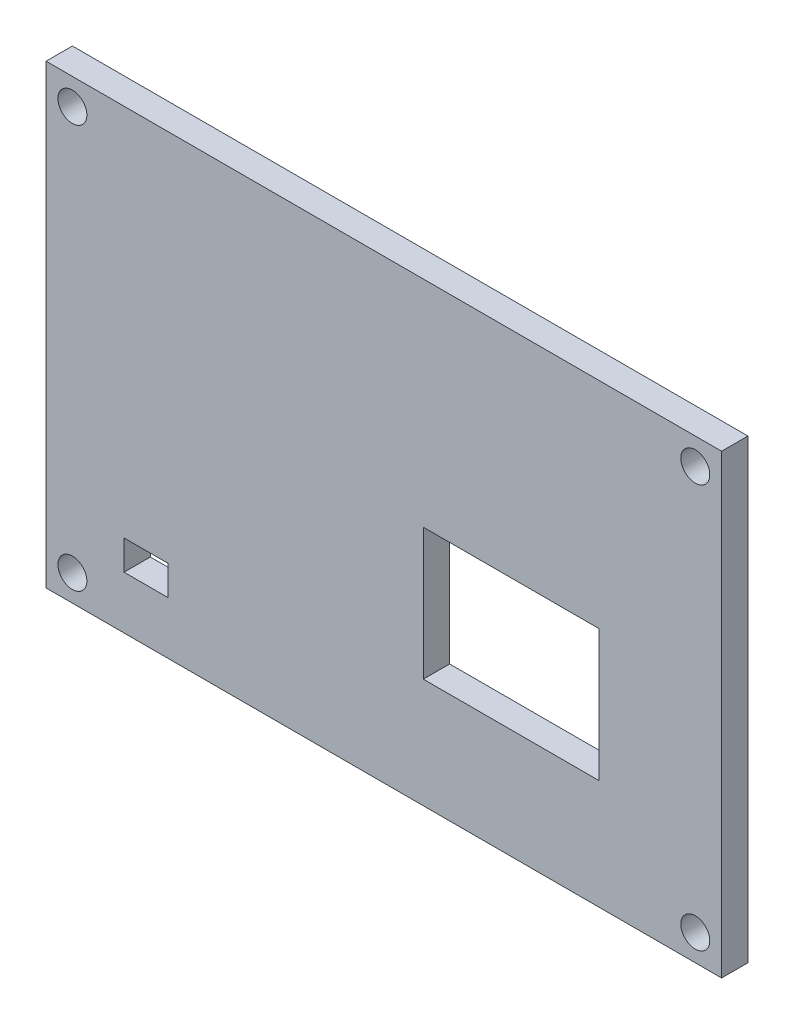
ISO-10303-21;
HEADER;
FILE_DESCRIPTION(('STEP AP214'),'2;1');
FILE_NAME('part.step','',(''),(''),'','','');
FILE_SCHEMA(('AUTOMOTIVE_DESIGN { 1 0 10303 214 1 1 1 1 }'));
ENDSEC;
DATA;
#1=APPLICATION_CONTEXT('core data for automotive mechanical design processes');
#2=APPLICATION_PROTOCOL_DEFINITION('international standard','automotive_design',2000,#1);
#3=PRODUCT_CONTEXT('',#1,'mechanical');
#4=PRODUCT('Part','Part','',(#3));
#5=PRODUCT_RELATED_PRODUCT_CATEGORY('part','',(#4));
#6=PRODUCT_DEFINITION_FORMATION('','',#4);
#7=PRODUCT_DEFINITION_CONTEXT('part definition',#1,'design');
#8=PRODUCT_DEFINITION('design','',#6,#7);
#9=PRODUCT_DEFINITION_SHAPE('','',#8);
#10=(LENGTH_UNIT() NAMED_UNIT(*) SI_UNIT(.MILLI.,.METRE.));
#11=(NAMED_UNIT(*) PLANE_ANGLE_UNIT() SI_UNIT($,.RADIAN.));
#12=(NAMED_UNIT(*) SI_UNIT($,.STERADIAN.) SOLID_ANGLE_UNIT());
#13=UNCERTAINTY_MEASURE_WITH_UNIT(LENGTH_MEASURE(1.E-05),#10,'distance_accuracy_value','');
#14=(GEOMETRIC_REPRESENTATION_CONTEXT(3) GLOBAL_UNCERTAINTY_ASSIGNED_CONTEXT((#13)) GLOBAL_UNIT_ASSIGNED_CONTEXT((#10,
#11,#12)) REPRESENTATION_CONTEXT('',''));
#15=CARTESIAN_POINT('',(0.,0.,0.));
#16=DIRECTION('',(0.,0.,1.));
#17=DIRECTION('',(1.,0.,0.));
#18=AXIS2_PLACEMENT_3D('',#15,#16,#17);
#19=CARTESIAN_POINT('',(0.,0.,3.));
#20=DIRECTION('',(0.,0.,-1.));
#21=DIRECTION('',(-1.,0.,0.));
#22=AXIS2_PLACEMENT_3D('',#19,#20,#21);
#23=PLANE('',#22);
#24=DIRECTION('',(0.,1.,0.));
#25=VECTOR('',#24,1.);
#26=CARTESIAN_POINT('',(24.5,-13.5,3.));
#27=LINE('',#26,#25);
#28=CARTESIAN_POINT('',(24.5,-13.5,3.));
#29=VERTEX_POINT('',#28);
#30=CARTESIAN_POINT('',(24.5,1.5,3.));
#31=VERTEX_POINT('',#30);
#32=EDGE_CURVE('E183',#29,#31,#27,.T.);
#33=ORIENTED_EDGE('',*,*,#32,.F.);
#34=DIRECTION('',(1.,0.,0.));
#35=VECTOR('',#34,1.);
#36=CARTESIAN_POINT('',(24.5,-13.5,3.));
#37=LINE('',#36,#35);
#38=CARTESIAN_POINT('',(4.5,-13.5,3.));
#39=VERTEX_POINT('',#38);
#40=EDGE_CURVE('E194',#39,#29,#37,.T.);
#41=ORIENTED_EDGE('',*,*,#40,.F.);
#42=DIRECTION('',(0.,-1.,0.));
#43=VECTOR('',#42,1.);
#44=CARTESIAN_POINT('',(4.5,-13.5,3.));
#45=LINE('',#44,#43);
#46=CARTESIAN_POINT('',(4.5,1.5,3.));
#47=VERTEX_POINT('',#46);
#48=EDGE_CURVE('E190',#47,#39,#45,.T.);
#49=ORIENTED_EDGE('',*,*,#48,.F.);
#50=DIRECTION('',(-1.,0.,0.));
#51=VECTOR('',#50,1.);
#52=CARTESIAN_POINT('',(24.5,1.5,3.));
#53=LINE('',#52,#51);
#54=EDGE_CURVE('E186',#31,#47,#53,.T.);
#55=ORIENTED_EDGE('',*,*,#54,.F.);
#56=EDGE_LOOP('',(#33,#41,#49,#55));
#57=FACE_BOUND('',#56,.T.);
#58=DIRECTION('',(0.,1.,0.));
#59=VECTOR('',#58,1.);
#60=CARTESIAN_POINT('',(38.5,-26.,3.));
#61=LINE('',#60,#59);
#62=CARTESIAN_POINT('',(38.5,-26.,3.));
#63=VERTEX_POINT('',#62);
#64=CARTESIAN_POINT('',(38.5,26.,3.));
#65=VERTEX_POINT('',#64);
#66=EDGE_CURVE('E258',#63,#65,#61,.T.);
#67=ORIENTED_EDGE('',*,*,#66,.T.);
#68=DIRECTION('',(-1.,0.,0.));
#69=VECTOR('',#68,1.);
#70=CARTESIAN_POINT('',(-38.5,26.,3.));
#71=LINE('',#70,#69);
#72=CARTESIAN_POINT('',(-38.5,26.,3.));
#73=VERTEX_POINT('',#72);
#74=EDGE_CURVE('E262',#65,#73,#71,.T.);
#75=ORIENTED_EDGE('',*,*,#74,.T.);
#76=DIRECTION('',(0.,-1.,0.));
#77=VECTOR('',#76,1.);
#78=CARTESIAN_POINT('',(-38.5,-26.,3.));
#79=LINE('',#78,#77);
#80=CARTESIAN_POINT('',(-38.5,-26.,3.));
#81=VERTEX_POINT('',#80);
#82=EDGE_CURVE('E266',#73,#81,#79,.T.);
#83=ORIENTED_EDGE('',*,*,#82,.T.);
#84=DIRECTION('',(1.,0.,0.));
#85=VECTOR('',#84,1.);
#86=CARTESIAN_POINT('',(-38.5,-26.,3.));
#87=LINE('',#86,#85);
#88=EDGE_CURVE('E269',#81,#63,#87,.T.);
#89=ORIENTED_EDGE('',*,*,#88,.T.);
#90=EDGE_LOOP('',(#67,#75,#83,#89));
#91=FACE_BOUND('',#90,.T.);
#92=CARTESIAN_POINT('',(-35.5,23.,3.));
#93=DIRECTION('',(0.,0.,1.));
#94=DIRECTION('',(1.,0.,0.));
#95=AXIS2_PLACEMENT_3D('',#92,#93,#94);
#96=CIRCLE('',#95,1.65);
#97=CARTESIAN_POINT('',(-33.85,23.,3.));
#98=VERTEX_POINT('',#97);
#99=EDGE_CURVE('E250',#98,#98,#96,.T.);
#100=ORIENTED_EDGE('',*,*,#99,.F.);
#101=EDGE_LOOP('',(#100));
#102=FACE_BOUND('',#101,.T.);
#103=CARTESIAN_POINT('',(35.5,23.,3.));
#104=DIRECTION('',(0.,0.,1.));
#105=DIRECTION('',(-1.,0.,0.));
#106=AXIS2_PLACEMENT_3D('',#103,#104,#105);
#107=CIRCLE('',#106,1.65);
#108=CARTESIAN_POINT('',(33.85,23.,3.));
#109=VERTEX_POINT('',#108);
#110=EDGE_CURVE('E242',#109,#109,#107,.T.);
#111=ORIENTED_EDGE('',*,*,#110,.F.);
#112=EDGE_LOOP('',(#111));
#113=FACE_BOUND('',#112,.T.);
#114=CARTESIAN_POINT('',(35.5,-23.,3.));
#115=DIRECTION('',(0.,0.,1.));
#116=DIRECTION('',(1.,0.,0.));
#117=AXIS2_PLACEMENT_3D('',#114,#115,#116);
#118=CIRCLE('',#117,1.65);
#119=CARTESIAN_POINT('',(37.15,-23.,3.));
#120=VERTEX_POINT('',#119);
#121=EDGE_CURVE('E234',#120,#120,#118,.T.);
#122=ORIENTED_EDGE('',*,*,#121,.F.);
#123=EDGE_LOOP('',(#122));
#124=FACE_BOUND('',#123,.T.);
#125=CARTESIAN_POINT('',(-35.5,-23.,3.));
#126=DIRECTION('',(0.,0.,1.));
#127=DIRECTION('',(-1.,0.,0.));
#128=AXIS2_PLACEMENT_3D('',#125,#126,#127);
#129=CIRCLE('',#128,1.65);
#130=CARTESIAN_POINT('',(-37.15,-23.,3.));
#131=VERTEX_POINT('',#130);
#132=EDGE_CURVE('E226',#131,#131,#129,.T.);
#133=ORIENTED_EDGE('',*,*,#132,.F.);
#134=EDGE_LOOP('',(#133));
#135=FACE_BOUND('',#134,.T.);
#136=DIRECTION('',(0.,-1.,0.));
#137=VECTOR('',#136,1.);
#138=CARTESIAN_POINT('',(-29.6153846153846,-20.,3.));
#139=LINE('',#138,#137);
#140=CARTESIAN_POINT('',(-29.6153846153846,-16.6183265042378,3.));
#141=VERTEX_POINT('',#140);
#142=CARTESIAN_POINT('',(-29.6153846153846,-20.,3.));
#143=VERTEX_POINT('',#142);
#144=EDGE_CURVE('E135',#141,#143,#139,.T.);
#145=ORIENTED_EDGE('',*,*,#144,.F.);
#146=DIRECTION('',(-1.,0.,0.));
#147=VECTOR('',#146,1.);
#148=CARTESIAN_POINT('',(-29.6153846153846,-16.6183265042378,3.));
#149=LINE('',#148,#147);
#150=CARTESIAN_POINT('',(-24.6079065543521,-16.6183265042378,3.));
#151=VERTEX_POINT('',#150);
#152=EDGE_CURVE('E161',#151,#141,#149,.T.);
#153=ORIENTED_EDGE('',*,*,#152,.F.);
#154=DIRECTION('',(0.,1.,0.));
#155=VECTOR('',#154,1.);
#156=CARTESIAN_POINT('',(-24.6079065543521,-20.,3.));
#157=LINE('',#156,#155);
#158=CARTESIAN_POINT('',(-24.6079065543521,-20.,3.));
#159=VERTEX_POINT('',#158);
#160=EDGE_CURVE('E157',#159,#151,#157,.T.);
#161=ORIENTED_EDGE('',*,*,#160,.F.);
#162=DIRECTION('',(1.,0.,0.));
#163=VECTOR('',#162,1.);
#164=CARTESIAN_POINT('',(-29.6153846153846,-20.,3.));
#165=LINE('',#164,#163);
#166=EDGE_CURVE('E144',#143,#159,#165,.T.);
#167=ORIENTED_EDGE('',*,*,#166,.F.);
#168=EDGE_LOOP('',(#145,#153,#161,#167));
#169=FACE_BOUND('',#168,.T.);
#170=ADVANCED_FACE('F45',(#57,#91,#102,#113,#124,#135,#169),#23,.F.);
#171=CARTESIAN_POINT('',(0.,0.,0.));
#172=DIRECTION('',(0.,0.,-1.));
#173=DIRECTION('',(-1.,0.,0.));
#174=AXIS2_PLACEMENT_3D('',#171,#172,#173);
#175=PLANE('',#174);
#176=CARTESIAN_POINT('',(35.5,-23.,0.));
#177=DIRECTION('',(0.,0.,1.));
#178=DIRECTION('',(1.,0.,0.));
#179=AXIS2_PLACEMENT_3D('',#176,#177,#178);
#180=CIRCLE('',#179,1.65);
#181=CARTESIAN_POINT('',(37.15,-23.,0.));
#182=VERTEX_POINT('',#181);
#183=EDGE_CURVE('E230',#182,#182,#180,.T.);
#184=ORIENTED_EDGE('',*,*,#183,.T.);
#185=EDGE_LOOP('',(#184));
#186=FACE_BOUND('',#185,.T.);
#187=CARTESIAN_POINT('',(-35.5,23.,0.));
#188=DIRECTION('',(0.,0.,1.));
#189=DIRECTION('',(1.,0.,0.));
#190=AXIS2_PLACEMENT_3D('',#187,#188,#189);
#191=CIRCLE('',#190,1.65);
#192=CARTESIAN_POINT('',(-33.85,23.,0.));
#193=VERTEX_POINT('',#192);
#194=EDGE_CURVE('E246',#193,#193,#191,.T.);
#195=ORIENTED_EDGE('',*,*,#194,.T.);
#196=EDGE_LOOP('',(#195));
#197=FACE_BOUND('',#196,.T.);
#198=DIRECTION('',(0.,1.,0.));
#199=VECTOR('',#198,1.);
#200=CARTESIAN_POINT('',(38.5,-26.,0.));
#201=LINE('',#200,#199);
#202=CARTESIAN_POINT('',(38.5,-26.,0.));
#203=VERTEX_POINT('',#202);
#204=CARTESIAN_POINT('',(38.5,26.,0.));
#205=VERTEX_POINT('',#204);
#206=EDGE_CURVE('E254',#203,#205,#201,.T.);
#207=ORIENTED_EDGE('',*,*,#206,.F.);
#208=DIRECTION('',(1.,0.,0.));
#209=VECTOR('',#208,1.);
#210=CARTESIAN_POINT('',(-38.5,-26.,0.));
#211=LINE('',#210,#209);
#212=CARTESIAN_POINT('',(-38.5,-26.,0.));
#213=VERTEX_POINT('',#212);
#214=EDGE_CURVE('E263',#213,#203,#211,.T.);
#215=ORIENTED_EDGE('',*,*,#214,.F.);
#216=DIRECTION('',(0.,-1.,0.));
#217=VECTOR('',#216,1.);
#218=CARTESIAN_POINT('',(-38.5,-26.,0.));
#219=LINE('',#218,#217);
#220=CARTESIAN_POINT('',(-38.5,26.,0.));
#221=VERTEX_POINT('',#220);
#222=EDGE_CURVE('E279',#221,#213,#219,.T.);
#223=ORIENTED_EDGE('',*,*,#222,.F.);
#224=DIRECTION('',(-1.,0.,0.));
#225=VECTOR('',#224,1.);
#226=CARTESIAN_POINT('',(-38.5,26.,0.));
#227=LINE('',#226,#225);
#228=EDGE_CURVE('E276',#205,#221,#227,.T.);
#229=ORIENTED_EDGE('',*,*,#228,.F.);
#230=EDGE_LOOP('',(#207,#215,#223,#229));
#231=FACE_BOUND('',#230,.T.);
#232=CARTESIAN_POINT('',(35.5,23.,0.));
#233=DIRECTION('',(0.,0.,1.));
#234=DIRECTION('',(-1.,0.,0.));
#235=AXIS2_PLACEMENT_3D('',#232,#233,#234);
#236=CIRCLE('',#235,1.65);
#237=CARTESIAN_POINT('',(33.85,23.,0.));
#238=VERTEX_POINT('',#237);
#239=EDGE_CURVE('E238',#238,#238,#236,.T.);
#240=ORIENTED_EDGE('',*,*,#239,.T.);
#241=EDGE_LOOP('',(#240));
#242=FACE_BOUND('',#241,.T.);
#243=CARTESIAN_POINT('',(-35.5,-23.,0.));
#244=DIRECTION('',(0.,0.,1.));
#245=DIRECTION('',(-1.,0.,0.));
#246=AXIS2_PLACEMENT_3D('',#243,#244,#245);
#247=CIRCLE('',#246,1.65);
#248=CARTESIAN_POINT('',(-37.15,-23.,0.));
#249=VERTEX_POINT('',#248);
#250=EDGE_CURVE('E225',#249,#249,#247,.T.);
#251=ORIENTED_EDGE('',*,*,#250,.T.);
#252=EDGE_LOOP('',(#251));
#253=FACE_BOUND('',#252,.T.);
#254=DIRECTION('',(1.,0.,0.));
#255=VECTOR('',#254,1.);
#256=CARTESIAN_POINT('',(24.5,-13.5,0.));
#257=LINE('',#256,#255);
#258=CARTESIAN_POINT('',(4.5,-13.5,0.));
#259=VERTEX_POINT('',#258);
#260=CARTESIAN_POINT('',(24.5,-13.5,0.));
#261=VERTEX_POINT('',#260);
#262=EDGE_CURVE('E187',#259,#261,#257,.T.);
#263=ORIENTED_EDGE('',*,*,#262,.T.);
#264=DIRECTION('',(0.,1.,0.));
#265=VECTOR('',#264,1.);
#266=CARTESIAN_POINT('',(24.5,-13.5,0.));
#267=LINE('',#266,#265);
#268=CARTESIAN_POINT('',(24.5,1.5,0.));
#269=VERTEX_POINT('',#268);
#270=EDGE_CURVE('E153',#261,#269,#267,.T.);
#271=ORIENTED_EDGE('',*,*,#270,.T.);
#272=DIRECTION('',(-1.,0.,0.));
#273=VECTOR('',#272,1.);
#274=CARTESIAN_POINT('',(24.5,1.5,0.));
#275=LINE('',#274,#273);
#276=CARTESIAN_POINT('',(4.5,1.5,0.));
#277=VERTEX_POINT('',#276);
#278=EDGE_CURVE('E201',#269,#277,#275,.T.);
#279=ORIENTED_EDGE('',*,*,#278,.T.);
#280=DIRECTION('',(0.,-1.,0.));
#281=VECTOR('',#280,1.);
#282=CARTESIAN_POINT('',(4.5,-13.5,0.));
#283=LINE('',#282,#281);
#284=EDGE_CURVE('E205',#277,#259,#283,.T.);
#285=ORIENTED_EDGE('',*,*,#284,.T.);
#286=EDGE_LOOP('',(#263,#271,#279,#285));
#287=FACE_BOUND('',#286,.T.);
#288=DIRECTION('',(-1.,0.,0.));
#289=VECTOR('',#288,1.);
#290=CARTESIAN_POINT('',(-29.6153846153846,-16.6183265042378,0.));
#291=LINE('',#290,#289);
#292=CARTESIAN_POINT('',(-24.6079065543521,-16.6183265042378,0.));
#293=VERTEX_POINT('',#292);
#294=CARTESIAN_POINT('',(-29.6153846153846,-16.6183265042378,0.));
#295=VERTEX_POINT('',#294);
#296=EDGE_CURVE('E145',#293,#295,#291,.T.);
#297=ORIENTED_EDGE('',*,*,#296,.T.);
#298=DIRECTION('',(0.,-1.,0.));
#299=VECTOR('',#298,1.);
#300=CARTESIAN_POINT('',(-29.6153846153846,-20.,0.));
#301=LINE('',#300,#299);
#302=CARTESIAN_POINT('',(-29.6153846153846,-20.,0.));
#303=VERTEX_POINT('',#302);
#304=EDGE_CURVE('E69',#295,#303,#301,.T.);
#305=ORIENTED_EDGE('',*,*,#304,.T.);
#306=DIRECTION('',(1.,0.,0.));
#307=VECTOR('',#306,1.);
#308=CARTESIAN_POINT('',(-29.6153846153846,-20.,0.));
#309=LINE('',#308,#307);
#310=CARTESIAN_POINT('',(-24.6079065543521,-20.,0.));
#311=VERTEX_POINT('',#310);
#312=EDGE_CURVE('E151',#303,#311,#309,.T.);
#313=ORIENTED_EDGE('',*,*,#312,.T.);
#314=DIRECTION('',(0.,1.,0.));
#315=VECTOR('',#314,1.);
#316=CARTESIAN_POINT('',(-24.6079065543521,-20.,0.));
#317=LINE('',#316,#315);
#318=EDGE_CURVE('E170',#311,#293,#317,.T.);
#319=ORIENTED_EDGE('',*,*,#318,.T.);
#320=EDGE_LOOP('',(#297,#305,#313,#319));
#321=FACE_BOUND('',#320,.T.);
#322=ADVANCED_FACE('F302',(#186,#197,#231,#242,#253,#287,#321),#175,.T.);
#323=CARTESIAN_POINT('',(38.5,-26.,3.));
#324=DIRECTION('',(-1.,0.,0.));
#325=DIRECTION('',(0.,0.,1.));
#326=AXIS2_PLACEMENT_3D('',#323,#324,#325);
#327=PLANE('',#326);
#328=ORIENTED_EDGE('',*,*,#206,.T.);
#329=DIRECTION('',(0.,0.,-1.));
#330=VECTOR('',#329,1.);
#331=CARTESIAN_POINT('',(38.5,26.,3.));
#332=LINE('',#331,#330);
#333=EDGE_CURVE('E11',#65,#205,#332,.T.);
#334=ORIENTED_EDGE('',*,*,#333,.F.);
#335=ORIENTED_EDGE('',*,*,#66,.F.);
#336=DIRECTION('',(0.,0.,-1.));
#337=VECTOR('',#336,1.);
#338=CARTESIAN_POINT('',(38.5,-26.,3.));
#339=LINE('',#338,#337);
#340=EDGE_CURVE('E272',#63,#203,#339,.T.);
#341=ORIENTED_EDGE('',*,*,#340,.T.);
#342=EDGE_LOOP('',(#328,#334,#335,#341));
#343=FACE_BOUND('',#342,.T.);
#344=ADVANCED_FACE('F47',(#343),#327,.F.);
#345=CARTESIAN_POINT('',(-38.5,26.,3.));
#346=DIRECTION('',(0.,-1.,0.));
#347=DIRECTION('',(0.,0.,-1.));
#348=AXIS2_PLACEMENT_3D('',#345,#346,#347);
#349=PLANE('',#348);
#350=ORIENTED_EDGE('',*,*,#228,.T.);
#351=DIRECTION('',(0.,0.,-1.));
#352=VECTOR('',#351,1.);
#353=CARTESIAN_POINT('',(-38.5,26.,3.));
#354=LINE('',#353,#352);
#355=EDGE_CURVE('E54',#73,#221,#354,.T.);
#356=ORIENTED_EDGE('',*,*,#355,.F.);
#357=ORIENTED_EDGE('',*,*,#74,.F.);
#358=ORIENTED_EDGE('',*,*,#333,.T.);
#359=EDGE_LOOP('',(#350,#356,#357,#358));
#360=FACE_BOUND('',#359,.T.);
#361=ADVANCED_FACE('F313',(#360),#349,.F.);
#362=CARTESIAN_POINT('',(-38.5,-26.,3.));
#363=DIRECTION('',(1.,0.,0.));
#364=DIRECTION('',(0.,0.,-1.));
#365=AXIS2_PLACEMENT_3D('',#362,#363,#364);
#366=PLANE('',#365);
#367=ORIENTED_EDGE('',*,*,#222,.T.);
#368=DIRECTION('',(0.,0.,-1.));
#369=VECTOR('',#368,1.);
#370=CARTESIAN_POINT('',(-38.5,-26.,3.));
#371=LINE('',#370,#369);
#372=EDGE_CURVE('E287',#81,#213,#371,.T.);
#373=ORIENTED_EDGE('',*,*,#372,.F.);
#374=ORIENTED_EDGE('',*,*,#82,.F.);
#375=ORIENTED_EDGE('',*,*,#355,.T.);
#376=EDGE_LOOP('',(#367,#373,#374,#375));
#377=FACE_BOUND('',#376,.T.);
#378=ADVANCED_FACE('F296',(#377),#366,.F.);
#379=CARTESIAN_POINT('',(-38.5,-26.,3.));
#380=DIRECTION('',(0.,1.,0.));
#381=DIRECTION('',(0.,0.,1.));
#382=AXIS2_PLACEMENT_3D('',#379,#380,#381);
#383=PLANE('',#382);
#384=ORIENTED_EDGE('',*,*,#214,.T.);
#385=ORIENTED_EDGE('',*,*,#340,.F.);
#386=ORIENTED_EDGE('',*,*,#88,.F.);
#387=ORIENTED_EDGE('',*,*,#372,.T.);
#388=EDGE_LOOP('',(#384,#385,#386,#387));
#389=FACE_BOUND('',#388,.T.);
#390=ADVANCED_FACE('F306',(#389),#383,.F.);
#391=CARTESIAN_POINT('',(-35.5,23.,3.));
#392=DIRECTION('',(0.,0.,-1.));
#393=DIRECTION('',(-1.,0.,0.));
#394=AXIS2_PLACEMENT_3D('',#391,#392,#393);
#395=CYLINDRICAL_SURFACE('',#394,1.65);
#396=ORIENTED_EDGE('',*,*,#99,.T.);
#397=EDGE_LOOP('',(#396));
#398=FACE_BOUND('',#397,.T.);
#399=ORIENTED_EDGE('',*,*,#194,.F.);
#400=EDGE_LOOP('',(#399));
#401=FACE_BOUND('',#400,.T.);
#402=ADVANCED_FACE('F330',(#398,#401),#395,.F.);
#403=CARTESIAN_POINT('',(35.5,23.,3.));
#404=DIRECTION('',(0.,0.,-1.));
#405=DIRECTION('',(-1.,0.,0.));
#406=AXIS2_PLACEMENT_3D('',#403,#404,#405);
#407=CYLINDRICAL_SURFACE('',#406,1.65);
#408=ORIENTED_EDGE('',*,*,#110,.T.);
#409=EDGE_LOOP('',(#408));
#410=FACE_BOUND('',#409,.T.);
#411=ORIENTED_EDGE('',*,*,#239,.F.);
#412=EDGE_LOOP('',(#411));
#413=FACE_BOUND('',#412,.T.);
#414=ADVANCED_FACE('F337',(#410,#413),#407,.F.);
#415=CARTESIAN_POINT('',(35.5,-23.,3.));
#416=DIRECTION('',(0.,0.,-1.));
#417=DIRECTION('',(-1.,0.,0.));
#418=AXIS2_PLACEMENT_3D('',#415,#416,#417);
#419=CYLINDRICAL_SURFACE('',#418,1.65);
#420=ORIENTED_EDGE('',*,*,#121,.T.);
#421=EDGE_LOOP('',(#420));
#422=FACE_BOUND('',#421,.T.);
#423=ORIENTED_EDGE('',*,*,#183,.F.);
#424=EDGE_LOOP('',(#423));
#425=FACE_BOUND('',#424,.T.);
#426=ADVANCED_FACE('F342',(#422,#425),#419,.F.);
#427=CARTESIAN_POINT('',(-35.5,-23.,3.));
#428=DIRECTION('',(0.,0.,-1.));
#429=DIRECTION('',(-1.,0.,0.));
#430=AXIS2_PLACEMENT_3D('',#427,#428,#429);
#431=CYLINDRICAL_SURFACE('',#430,1.65);
#432=ORIENTED_EDGE('',*,*,#132,.T.);
#433=EDGE_LOOP('',(#432));
#434=FACE_BOUND('',#433,.T.);
#435=ORIENTED_EDGE('',*,*,#250,.F.);
#436=EDGE_LOOP('',(#435));
#437=FACE_BOUND('',#436,.T.);
#438=ADVANCED_FACE('F355',(#434,#437),#431,.F.);
#439=CARTESIAN_POINT('',(24.5,-13.5,3.));
#440=DIRECTION('',(-1.,0.,0.));
#441=DIRECTION('',(0.,0.,1.));
#442=AXIS2_PLACEMENT_3D('',#439,#440,#441);
#443=PLANE('',#442);
#444=ORIENTED_EDGE('',*,*,#270,.F.);
#445=DIRECTION('',(0.,0.,-1.));
#446=VECTOR('',#445,1.);
#447=CARTESIAN_POINT('',(24.5,-13.5,3.));
#448=LINE('',#447,#446);
#449=EDGE_CURVE('E197',#29,#261,#448,.T.);
#450=ORIENTED_EDGE('',*,*,#449,.F.);
#451=ORIENTED_EDGE('',*,*,#32,.T.);
#452=DIRECTION('',(0.,0.,-1.));
#453=VECTOR('',#452,1.);
#454=CARTESIAN_POINT('',(24.5,1.5,3.));
#455=LINE('',#454,#453);
#456=EDGE_CURVE('E221',#31,#269,#455,.T.);
#457=ORIENTED_EDGE('',*,*,#456,.T.);
#458=EDGE_LOOP('',(#444,#450,#451,#457));
#459=FACE_BOUND('',#458,.T.);
#460=ADVANCED_FACE('F358',(#459),#443,.T.);
#461=CARTESIAN_POINT('',(24.5,1.5,3.));
#462=DIRECTION('',(0.,-1.,0.));
#463=DIRECTION('',(1.,0.,0.));
#464=AXIS2_PLACEMENT_3D('',#461,#462,#463);
#465=PLANE('',#464);
#466=ORIENTED_EDGE('',*,*,#278,.F.);
#467=ORIENTED_EDGE('',*,*,#456,.F.);
#468=ORIENTED_EDGE('',*,*,#54,.T.);
#469=DIRECTION('',(0.,0.,-1.));
#470=VECTOR('',#469,1.);
#471=CARTESIAN_POINT('',(4.5,1.5,3.));
#472=LINE('',#471,#470);
#473=EDGE_CURVE('E218',#47,#277,#472,.T.);
#474=ORIENTED_EDGE('',*,*,#473,.T.);
#475=EDGE_LOOP('',(#466,#467,#468,#474));
#476=FACE_BOUND('',#475,.T.);
#477=ADVANCED_FACE('F387',(#476),#465,.T.);
#478=CARTESIAN_POINT('',(4.5,-13.5,3.));
#479=DIRECTION('',(1.,0.,0.));
#480=DIRECTION('',(0.,0.,-1.));
#481=AXIS2_PLACEMENT_3D('',#478,#479,#480);
#482=PLANE('',#481);
#483=ORIENTED_EDGE('',*,*,#284,.F.);
#484=ORIENTED_EDGE('',*,*,#473,.F.);
#485=ORIENTED_EDGE('',*,*,#48,.T.);
#486=DIRECTION('',(0.,0.,-1.));
#487=VECTOR('',#486,1.);
#488=CARTESIAN_POINT('',(4.5,-13.5,3.));
#489=LINE('',#488,#487);
#490=EDGE_CURVE('E215',#39,#259,#489,.T.);
#491=ORIENTED_EDGE('',*,*,#490,.T.);
#492=EDGE_LOOP('',(#483,#484,#485,#491));
#493=FACE_BOUND('',#492,.T.);
#494=ADVANCED_FACE('F383',(#493),#482,.T.);
#495=CARTESIAN_POINT('',(24.5,-13.5,3.));
#496=DIRECTION('',(0.,1.,0.));
#497=DIRECTION('',(-1.,0.,0.));
#498=AXIS2_PLACEMENT_3D('',#495,#496,#497);
#499=PLANE('',#498);
#500=ORIENTED_EDGE('',*,*,#262,.F.);
#501=ORIENTED_EDGE('',*,*,#490,.F.);
#502=ORIENTED_EDGE('',*,*,#40,.T.);
#503=ORIENTED_EDGE('',*,*,#449,.T.);
#504=EDGE_LOOP('',(#500,#501,#502,#503));
#505=FACE_BOUND('',#504,.T.);
#506=ADVANCED_FACE('F380',(#505),#499,.T.);
#507=CARTESIAN_POINT('',(-29.6153846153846,-20.,3.));
#508=DIRECTION('',(1.,0.,0.));
#509=DIRECTION('',(0.,0.,-1.));
#510=AXIS2_PLACEMENT_3D('',#507,#508,#509);
#511=PLANE('',#510);
#512=ORIENTED_EDGE('',*,*,#304,.F.);
#513=DIRECTION('',(0.,0.,-1.));
#514=VECTOR('',#513,1.);
#515=CARTESIAN_POINT('',(-29.6153846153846,-16.6183265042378,3.));
#516=LINE('',#515,#514);
#517=EDGE_CURVE('E139',#141,#295,#516,.T.);
#518=ORIENTED_EDGE('',*,*,#517,.F.);
#519=ORIENTED_EDGE('',*,*,#144,.T.);
#520=DIRECTION('',(0.,0.,-1.));
#521=VECTOR('',#520,1.);
#522=CARTESIAN_POINT('',(-29.6153846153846,-20.,3.));
#523=LINE('',#522,#521);
#524=EDGE_CURVE('E138',#143,#303,#523,.T.);
#525=ORIENTED_EDGE('',*,*,#524,.T.);
#526=EDGE_LOOP('',(#512,#518,#519,#525));
#527=FACE_BOUND('',#526,.T.);
#528=ADVANCED_FACE('F137',(#527),#511,.T.);
#529=CARTESIAN_POINT('',(-29.6153846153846,-20.,3.));
#530=DIRECTION('',(0.,1.,0.));
#531=DIRECTION('',(0.,0.,1.));
#532=AXIS2_PLACEMENT_3D('',#529,#530,#531);
#533=PLANE('',#532);
#534=ORIENTED_EDGE('',*,*,#312,.F.);
#535=ORIENTED_EDGE('',*,*,#524,.F.);
#536=ORIENTED_EDGE('',*,*,#166,.T.);
#537=DIRECTION('',(0.,0.,-1.));
#538=VECTOR('',#537,1.);
#539=CARTESIAN_POINT('',(-24.6079065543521,-20.,3.));
#540=LINE('',#539,#538);
#541=EDGE_CURVE('E154',#159,#311,#540,.T.);
#542=ORIENTED_EDGE('',*,*,#541,.T.);
#543=EDGE_LOOP('',(#534,#535,#536,#542));
#544=FACE_BOUND('',#543,.T.);
#545=ADVANCED_FACE('F148',(#544),#533,.T.);
#546=CARTESIAN_POINT('',(-24.6079065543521,-20.,3.));
#547=DIRECTION('',(-1.,0.,0.));
#548=DIRECTION('',(0.,-1.,0.));
#549=AXIS2_PLACEMENT_3D('',#546,#547,#548);
#550=PLANE('',#549);
#551=ORIENTED_EDGE('',*,*,#318,.F.);
#552=ORIENTED_EDGE('',*,*,#541,.F.);
#553=ORIENTED_EDGE('',*,*,#160,.T.);
#554=DIRECTION('',(0.,0.,-1.));
#555=VECTOR('',#554,1.);
#556=CARTESIAN_POINT('',(-24.6079065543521,-16.6183265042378,3.));
#557=LINE('',#556,#555);
#558=EDGE_CURVE('E61',#151,#293,#557,.T.);
#559=ORIENTED_EDGE('',*,*,#558,.T.);
#560=EDGE_LOOP('',(#551,#552,#553,#559));
#561=FACE_BOUND('',#560,.T.);
#562=ADVANCED_FACE('F368',(#561),#550,.T.);
#563=CARTESIAN_POINT('',(-29.6153846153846,-16.6183265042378,3.));
#564=DIRECTION('',(0.,-1.,0.));
#565=DIRECTION('',(1.,0.,0.));
#566=AXIS2_PLACEMENT_3D('',#563,#564,#565);
#567=PLANE('',#566);
#568=ORIENTED_EDGE('',*,*,#296,.F.);
#569=ORIENTED_EDGE('',*,*,#558,.F.);
#570=ORIENTED_EDGE('',*,*,#152,.T.);
#571=ORIENTED_EDGE('',*,*,#517,.T.);
#572=EDGE_LOOP('',(#568,#569,#570,#571));
#573=FACE_BOUND('',#572,.T.);
#574=ADVANCED_FACE('F366',(#573),#567,.T.);
#575=CLOSED_SHELL('',(#170,#322,#344,#361,#378,#390,#402,#414,#426,#438,#460,#477,#494,#506,
#528,#545,#562,#574));
#576=MANIFOLD_SOLID_BREP('B2',#575);
#577=ADVANCED_BREP_SHAPE_REPRESENTATION('',(#18,#576),#14);
#578=SHAPE_DEFINITION_REPRESENTATION(#9,#577);
ENDSEC;
END-ISO-10303-21;
